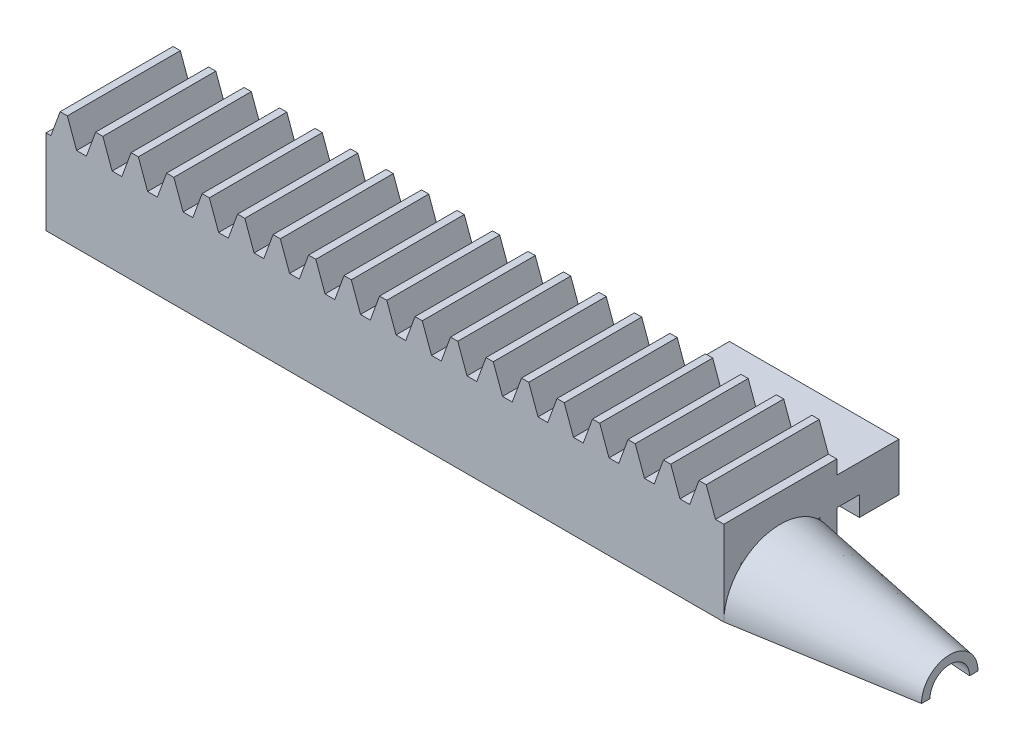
from build123d import *

# Parameters (mm, degrees)
BLANKSKE_W          = 120
BLANKSKE_H          = 12
BLANK_DEPTH         = 20
TOOTHCUTSIM_DEPTH   = 123.245654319
TEETHCUTS_COUNT     = 20
TEETHCUTS_PITCH     = 6.2831853
SKETCH_1_W          = 120
SKETCH_1_H          = 3
EXTRUDE_1_DEPTH     = 7.5
EXTRUDE_2_DEPTH     = 30
SKETCH_5_R          = 10
SKETCH_6_R          = 5
CUT_EXTRUDE_3_DEPTH = 42
SKETCH_10_R         = 3.5
CUT_EXTRUDE_4_DEPTH = 42
CUT_EXTRUDE_4_DRAFT = 4


with BuildPart() as part:
    # BlankSke → Blank (new body)
    with BuildSketch(Plane.XY):
        with Locations((60, 6)):
            Rectangle(BLANKSKE_W, BLANKSKE_H)
    extrude(amount=-BLANK_DEPTH)

    # TooCutSkeSim → ToothCutSim (cut, through all)
    with BuildSketch(Plane.XY):
        Polygon((0.861870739, 7.5), (-0.861870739, 7.5), (-2.508981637, 12.0254), (2.508981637, 12.0254), align=None)
    toothcutsim = extrude(amount=-TOOTHCUTSIM_DEPTH, mode=Mode.SUBTRACT)

    # TeethCuts: ToothCutSim ×20
    with Locations(*[(i * TEETHCUTS_PITCH, 0, 0) for i in range(1, TEETHCUTS_COUNT)]):
        add(toothcutsim, mode=Mode.SUBTRACT)

    # Sketch 1 → Extrude 1 (add)
    with BuildSketch(Plane.XZ):
        with Locations((60, -18.5)):
            Rectangle(SKETCH_1_W, SKETCH_1_H)
        with Locations((60, -1.5)):
            Rectangle(SKETCH_1_W, SKETCH_1_H)
    extrude(amount=EXTRUDE_1_DEPTH)

    # Sketch 4 → Extrude 2 (add)
    with BuildSketch(Plane(origin=(120, 0, 0), x_dir=(0, 0, -1), z_dir=(1, 0, 0))):
        Polygon((20, 0.02), (20, 5.02), (31, 5.02), (31, -3.48), (24, -3.48), (24, 0.02), align=None)
    extrude(amount=-EXTRUDE_2_DEPTH)

    # Sketch 5 → Loft 2 section 0
    with BuildSketch(Plane(origin=(120, 0, 0), x_dir=(0, 0, -1), z_dir=(1, 0, 0))):
        with Locations((10, -7.5)):
            Circle(SKETCH_5_R)
    # Sketch 6 → Loft 2 section 1
    with BuildSketch(Plane(origin=(150, 0, 0), x_dir=(0, 0, -1), z_dir=(1, 0, 0))):
        with Locations((10, -7.5)):
            Circle(SKETCH_6_R)
    loft()

    # Sketch 7 → Cut-Extrude 3 (cut)
    with BuildSketch(Plane(origin=(150, 0, 0), x_dir=(0, 0, -1), z_dir=(1, 0, 0))):
        Polygon((29.208936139, -7.5), (22.699050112, -25.700074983), (-6.249709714, -20.162428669), (-7.297866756, -7.5), align=None)
    extrude(amount=-CUT_EXTRUDE_3_DEPTH, mode=Mode.SUBTRACT)


with BuildPart() as cut_extrude_4_tool:
    # Sketch 10 → Cut-Extrude 4 (with draft: the straight prism first)
    with BuildSketch(Plane(origin=(150, 0, 0), x_dir=(0, 0, -1), z_dir=(1, 0, 0))):
        with Locations((10, -7.5)):
            Circle(SKETCH_10_R)
    extrude(amount=-CUT_EXTRUDE_4_DEPTH)
    # Cut-Extrude 4: the draft: its side faces are tilted about the plane it starts from
    cut_extrude_4_sides = [cut_extrude_4_tool.faces().sort_by_distance(p)[0] for p in [
        (129, -7.5, -6.5),
    ]]
    draft(cut_extrude_4_sides, Plane(origin=(150, 0, 0), x_dir=(0, 0, -1), z_dir=(1, 0, 0)), CUT_EXTRUDE_4_DRAFT)


with BuildPart() as part_1:
    add(part.part)

    # Cut-Extrude 4: cut by cut_extrude_4_tool
    add(cut_extrude_4_tool.part, mode=Mode.SUBTRACT)


solid = part_1.part
